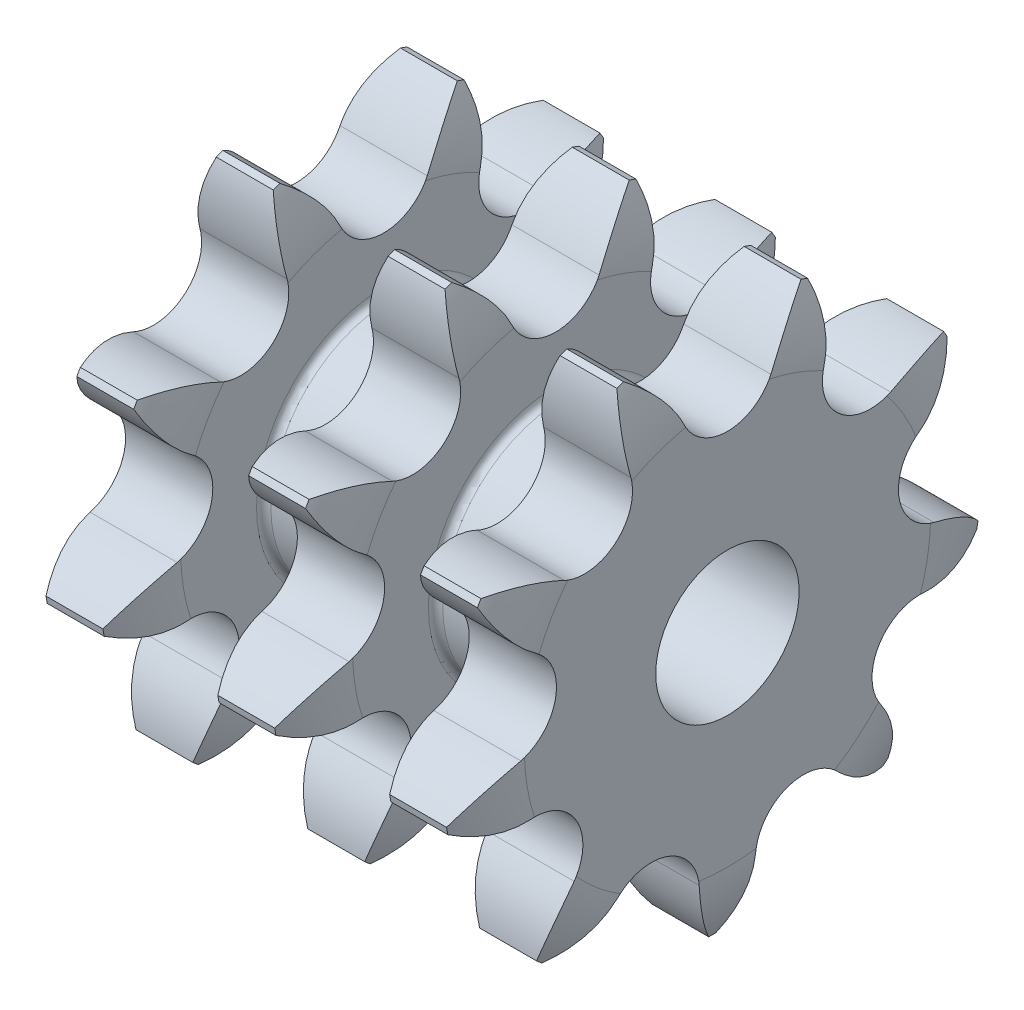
from build123d import *

# Parameters (mm, degrees)
GROOVES_COUNT   = 2
GROOVES_PITCH   = 14.38
TOOTHCUT_DEPTH  = 49.118649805
TEETHCUTS_COUNT = 9
TEETHCUTS_ANGLE = 320
BORSKE_R        = 6
BORE_DEPTH      = 38.2605


with BuildPart() as part:
    # BasProSke → Base-Revolve (revolve)
    with BuildSketch(Plane(origin=(0, 0, 0), x_dir=(1, 0, 0), z_dir=(0, 1, 0)), mode=Mode.PRIVATE) as base_revolve_sk:
        with BuildLine():
            Line((0, 0), (0, 16.992856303))
            ThreePointArc((0, 16.992856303), (0.321571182, 19.832662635), (1.27, 22.528657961))
            Line((1.27, 22.528657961), (34.79, 22.528657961))
            ThreePointArc((34.79, 22.528657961), (35.738428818, 19.832662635), (36.06, 16.992856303))
            Line((36.06, 16.992856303), (36.06, 0))
            Line((36.06, 0), (0, 0))
        make_face()
    revolve(base_revolve_sk.sketch.rotate(Axis((-10, 0, 0), (1, 0, 0)), 180), axis=Axis((-10, 0, 0), (1, 0, 0)))

    # GrvSke → Groove (revolve, cut)
    with BuildSketch(Plane(origin=(0, 0, 0), x_dir=(1, 0, 0), z_dir=(0, 1, 0)), mode=Mode.PRIVATE) as groove_sk:
        with BuildLine():
            Line((7.3, 16.992856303), (7.3, 10.646481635))
            ThreePointArc((7.3, 10.646481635), (7.475735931, 10.222217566), (7.9, 10.046481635))
            Line((7.9, 10.046481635), (13.78, 10.046481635))
            ThreePointArc((13.78, 10.046481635), (14.204264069, 10.222217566), (14.38, 10.646481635))
            Line((14.38, 10.646481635), (14.38, 16.992856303))
            ThreePointArc((14.38, 16.992856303), (14.701571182, 19.832662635), (15.65, 22.528657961))
            Line((15.65, 22.528657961), (6.03, 22.528657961))
            ThreePointArc((6.03, 22.528657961), (6.978428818, 19.832662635), (7.3, 16.992856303))
        make_face()
    groove = revolve(groove_sk.sketch.rotate(Axis((0, 0, 0), (1, 0, 0)), 180), axis=Axis((0, 0, 0), (1, 0, 0)), mode=Mode.SUBTRACT)

    # Grooves: Groove ×2
    with Locations(*[(i * GROOVES_PITCH, 0, 0) for i in range(1, GROOVES_COUNT)]):
        add(groove, mode=Mode.SUBTRACT)

    # TooCutSke → ToothCut (cut, through all)
    with BuildSketch(Plane(origin=(0, 0, 0), x_dir=(0, 0, -1), z_dir=(1, 0, 0))):
        with BuildLine():
            ThreePointArc((3.638599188, 16.909201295), (5.440645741, 19.594585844), (7.97480479, 21.603739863))
            ThreePointArc((7.97480479, 21.603739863), (0, 23.028657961), (-7.97480479, 21.603739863))
            ThreePointArc((-7.97480479, 21.603739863), (-5.440645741, 19.594585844), (-3.638599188, 16.909201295))
            ThreePointArc((-3.638599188, 16.909201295), (0, 14.591157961), (3.638599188, 16.909201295))
        make_face()
    toothcut = extrude(amount=TOOTHCUT_DEPTH, mode=Mode.SUBTRACT)

    # TeethCuts: ToothCut ×9 about axis
    teethcuts_axis = Axis((-10, 0, 0), (1, 0, 0))
    for i in range(1, TEETHCUTS_COUNT):
        add(toothcut.rotate(teethcuts_axis, i * TEETHCUTS_ANGLE / (TEETHCUTS_COUNT - 1)), mode=Mode.SUBTRACT)

    # BorSke → Bore (cut, symmetric)
    with BuildSketch(Plane(origin=(0, 0, 0), x_dir=(0, 0, -1), z_dir=(1, 0, 0))):
        with Locations(Location((0, 0, 0), (0, 0, 180))):
            Circle(BORSKE_R)
    extrude(amount=BORE_DEPTH, both=True, mode=Mode.SUBTRACT)


solid = part.part
